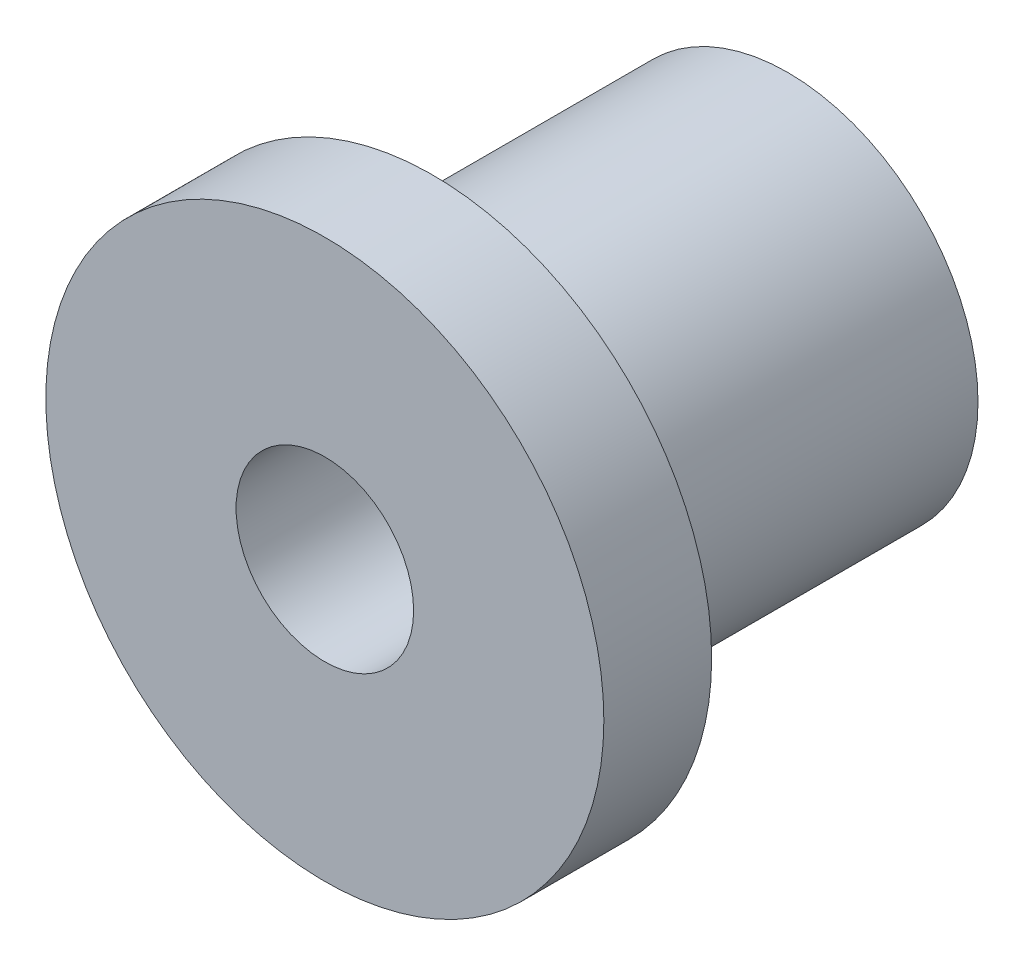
ISO-10303-21;
HEADER;
FILE_DESCRIPTION(('STEP AP214'),'2;1');
FILE_NAME('part.step','',(''),(''),'','','');
FILE_SCHEMA(('AUTOMOTIVE_DESIGN { 1 0 10303 214 1 1 1 1 }'));
ENDSEC;
DATA;
#1=APPLICATION_CONTEXT('core data for automotive mechanical design processes');
#2=APPLICATION_PROTOCOL_DEFINITION('international standard','automotive_design',2000,#1);
#3=PRODUCT_CONTEXT('',#1,'mechanical');
#4=PRODUCT('Part','Part','',(#3));
#5=PRODUCT_RELATED_PRODUCT_CATEGORY('part','',(#4));
#6=PRODUCT_DEFINITION_FORMATION('','',#4);
#7=PRODUCT_DEFINITION_CONTEXT('part definition',#1,'design');
#8=PRODUCT_DEFINITION('design','',#6,#7);
#9=PRODUCT_DEFINITION_SHAPE('','',#8);
#10=(LENGTH_UNIT() NAMED_UNIT(*) SI_UNIT(.MILLI.,.METRE.));
#11=(NAMED_UNIT(*) PLANE_ANGLE_UNIT() SI_UNIT($,.RADIAN.));
#12=(NAMED_UNIT(*) SI_UNIT($,.STERADIAN.) SOLID_ANGLE_UNIT());
#13=UNCERTAINTY_MEASURE_WITH_UNIT(LENGTH_MEASURE(1.E-05),#10,'distance_accuracy_value','');
#14=(GEOMETRIC_REPRESENTATION_CONTEXT(3) GLOBAL_UNCERTAINTY_ASSIGNED_CONTEXT((#13)) GLOBAL_UNIT_ASSIGNED_CONTEXT((#10,
#11,#12)) REPRESENTATION_CONTEXT('',''));
#15=CARTESIAN_POINT('',(0.,0.,0.));
#16=DIRECTION('',(0.,0.,1.));
#17=DIRECTION('',(1.,0.,0.));
#18=AXIS2_PLACEMENT_3D('',#15,#16,#17);
#19=CARTESIAN_POINT('',(0.,0.,7.11199999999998));
#20=DIRECTION('',(0.,0.,-1.));
#21=DIRECTION('',(-1.,0.,0.));
#22=AXIS2_PLACEMENT_3D('',#19,#20,#21);
#23=CYLINDRICAL_SURFACE('',#22,3.81);
#24=CARTESIAN_POINT('',(0.,0.,7.11199999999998));
#25=DIRECTION('',(0.,0.,1.));
#26=DIRECTION('',(1.,0.,0.));
#27=AXIS2_PLACEMENT_3D('',#24,#25,#26);
#28=CIRCLE('',#27,3.81);
#29=CARTESIAN_POINT('',(3.80999999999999,0.,7.11199999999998));
#30=VERTEX_POINT('',#29);
#31=EDGE_CURVE('E10',#30,#30,#28,.T.);
#32=ORIENTED_EDGE('',*,*,#31,.F.);
#33=EDGE_LOOP('',(#32));
#34=FACE_BOUND('',#33,.T.);
#35=CARTESIAN_POINT('',(0.,0.,0.));
#36=DIRECTION('',(0.,0.,1.));
#37=DIRECTION('',(1.,0.,0.));
#38=AXIS2_PLACEMENT_3D('',#35,#36,#37);
#39=CIRCLE('',#38,3.81);
#40=CARTESIAN_POINT('',(3.80999999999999,0.,0.));
#41=VERTEX_POINT('',#40);
#42=EDGE_CURVE('E34',#41,#41,#39,.T.);
#43=ORIENTED_EDGE('',*,*,#42,.T.);
#44=EDGE_LOOP('',(#43));
#45=FACE_BOUND('',#44,.T.);
#46=ADVANCED_FACE('F28',(#34,#45),#23,.T.);
#47=CARTESIAN_POINT('',(0.,0.,0.));
#48=DIRECTION('',(0.,0.,1.));
#49=DIRECTION('',(1.,0.,0.));
#50=AXIS2_PLACEMENT_3D('',#47,#48,#49);
#51=PLANE('',#50);
#52=ORIENTED_EDGE('',*,*,#42,.F.);
#53=EDGE_LOOP('',(#52));
#54=FACE_BOUND('',#53,.T.);
#55=ADVANCED_FACE('F70',(#54),#51,.F.);
#56=CARTESIAN_POINT('',(0.,0.,7.11199999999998));
#57=DIRECTION('',(0.,0.,1.));
#58=DIRECTION('',(1.,0.,0.));
#59=AXIS2_PLACEMENT_3D('',#56,#57,#58);
#60=PLANE('',#59);
#61=CARTESIAN_POINT('',(0.,0.,7.11199999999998));
#62=DIRECTION('',(0.,0.,1.));
#63=DIRECTION('',(1.,0.,0.));
#64=AXIS2_PLACEMENT_3D('',#61,#62,#63);
#65=CIRCLE('',#64,5.588);
#66=CARTESIAN_POINT('',(5.58799999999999,0.,7.11199999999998));
#67=VERTEX_POINT('',#66);
#68=EDGE_CURVE('E42',#67,#67,#65,.T.);
#69=ORIENTED_EDGE('',*,*,#68,.F.);
#70=EDGE_LOOP('',(#69));
#71=FACE_BOUND('',#70,.T.);
#72=ORIENTED_EDGE('',*,*,#31,.T.);
#73=EDGE_LOOP('',(#72));
#74=FACE_BOUND('',#73,.T.);
#75=ADVANCED_FACE('F65',(#71,#74),#60,.F.);
#76=CARTESIAN_POINT('',(0.,0.,9.27099999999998));
#77=DIRECTION('',(0.,0.,-1.));
#78=DIRECTION('',(-1.,0.,0.));
#79=AXIS2_PLACEMENT_3D('',#76,#77,#78);
#80=CYLINDRICAL_SURFACE('',#79,5.588);
#81=CARTESIAN_POINT('',(0.,0.,9.27099999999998));
#82=DIRECTION('',(0.,0.,1.));
#83=DIRECTION('',(1.,0.,0.));
#84=AXIS2_PLACEMENT_3D('',#81,#82,#83);
#85=CIRCLE('',#84,5.588);
#86=CARTESIAN_POINT('',(5.58799999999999,0.,9.27099999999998));
#87=VERTEX_POINT('',#86);
#88=EDGE_CURVE('E38',#87,#87,#85,.T.);
#89=ORIENTED_EDGE('',*,*,#88,.F.);
#90=EDGE_LOOP('',(#89));
#91=FACE_BOUND('',#90,.T.);
#92=ORIENTED_EDGE('',*,*,#68,.T.);
#93=EDGE_LOOP('',(#92));
#94=FACE_BOUND('',#93,.T.);
#95=ADVANCED_FACE('F59',(#91,#94),#80,.T.);
#96=CARTESIAN_POINT('',(0.,0.,9.27099999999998));
#97=DIRECTION('',(0.,0.,1.));
#98=DIRECTION('',(1.,0.,0.));
#99=AXIS2_PLACEMENT_3D('',#96,#97,#98);
#100=PLANE('',#99);
#101=CARTESIAN_POINT('',(0.,0.,9.27099999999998));
#102=DIRECTION('',(0.,0.,1.));
#103=DIRECTION('',(1.,0.,0.));
#104=AXIS2_PLACEMENT_3D('',#101,#102,#103);
#105=CIRCLE('',#104,1.778);
#106=CARTESIAN_POINT('',(1.77799999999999,0.,9.27099999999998));
#107=VERTEX_POINT('',#106);
#108=EDGE_CURVE('E50',#107,#107,#105,.T.);
#109=ORIENTED_EDGE('',*,*,#108,.F.);
#110=EDGE_LOOP('',(#109));
#111=FACE_BOUND('',#110,.T.);
#112=ORIENTED_EDGE('',*,*,#88,.T.);
#113=EDGE_LOOP('',(#112));
#114=FACE_BOUND('',#113,.T.);
#115=ADVANCED_FACE('F56',(#111,#114),#100,.T.);
#116=CARTESIAN_POINT('',(0.,0.,6.47699999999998));
#117=DIRECTION('',(0.,0.,1.));
#118=DIRECTION('',(1.,0.,0.));
#119=AXIS2_PLACEMENT_3D('',#116,#117,#118);
#120=CYLINDRICAL_SURFACE('',#119,1.778);
#121=CARTESIAN_POINT('',(0.,0.,6.47699999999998));
#122=DIRECTION('',(0.,0.,1.));
#123=DIRECTION('',(1.,0.,0.));
#124=AXIS2_PLACEMENT_3D('',#121,#122,#123);
#125=CIRCLE('',#124,1.778);
#126=CARTESIAN_POINT('',(1.77799999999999,0.,6.47699999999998));
#127=VERTEX_POINT('',#126);
#128=EDGE_CURVE('E47',#127,#127,#125,.T.);
#129=ORIENTED_EDGE('',*,*,#128,.F.);
#130=EDGE_LOOP('',(#129));
#131=FACE_BOUND('',#130,.T.);
#132=ORIENTED_EDGE('',*,*,#108,.T.);
#133=EDGE_LOOP('',(#132));
#134=FACE_BOUND('',#133,.T.);
#135=ADVANCED_FACE('F54',(#131,#134),#120,.F.);
#136=CARTESIAN_POINT('',(0.,0.,6.47699999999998));
#137=DIRECTION('',(0.,0.,1.));
#138=DIRECTION('',(1.,0.,0.));
#139=AXIS2_PLACEMENT_3D('',#136,#137,#138);
#140=PLANE('',#139);
#141=ORIENTED_EDGE('',*,*,#128,.T.);
#142=EDGE_LOOP('',(#141));
#143=FACE_BOUND('',#142,.T.);
#144=ADVANCED_FACE('F102',(#143),#140,.T.);
#145=CLOSED_SHELL('',(#46,#55,#75,#95,#115,#135,#144));
#146=MANIFOLD_SOLID_BREP('B2',#145);
#147=ADVANCED_BREP_SHAPE_REPRESENTATION('',(#18,#146),#14);
#148=SHAPE_DEFINITION_REPRESENTATION(#9,#147);
ENDSEC;
END-ISO-10303-21;
